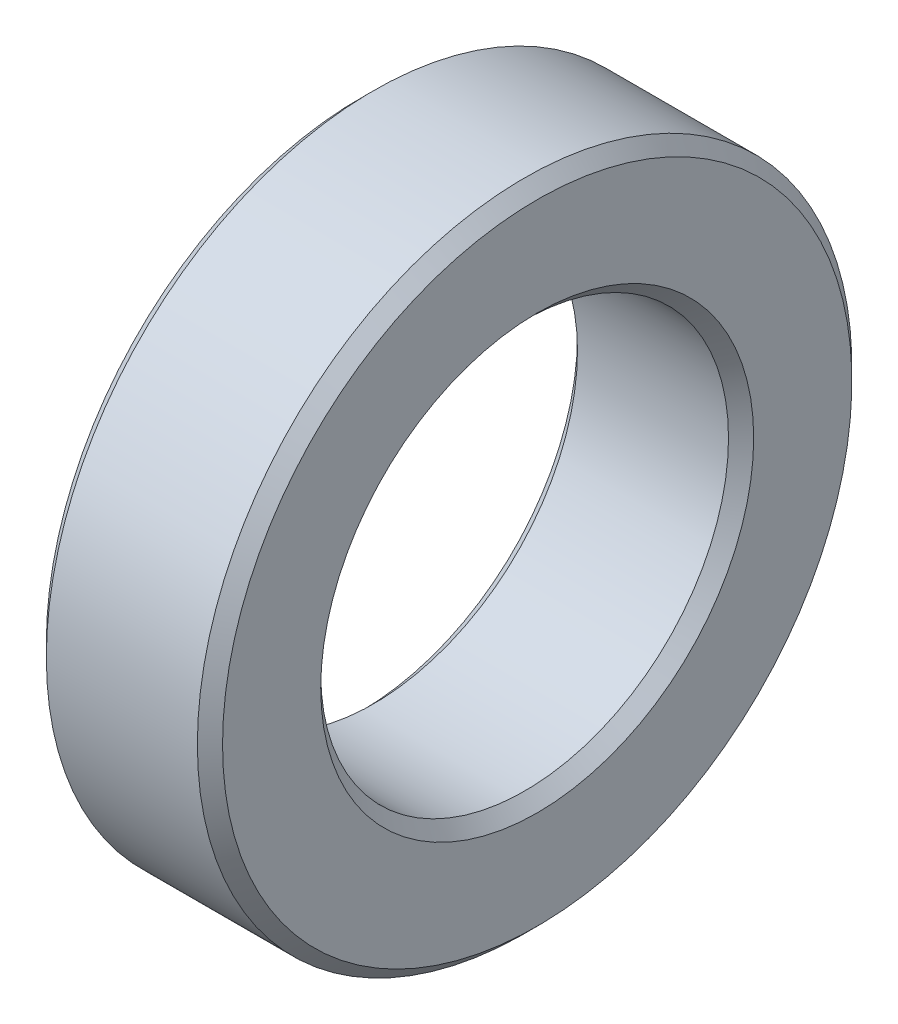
ISO-10303-21;
HEADER;
FILE_DESCRIPTION(('STEP AP214'),'2;1');
FILE_NAME('part.step','',(''),(''),'','','');
FILE_SCHEMA(('AUTOMOTIVE_DESIGN { 1 0 10303 214 1 1 1 1 }'));
ENDSEC;
DATA;
#1=APPLICATION_CONTEXT('core data for automotive mechanical design processes');
#2=APPLICATION_PROTOCOL_DEFINITION('international standard','automotive_design',2000,#1);
#3=PRODUCT_CONTEXT('',#1,'mechanical');
#4=PRODUCT('Part','Part','',(#3));
#5=PRODUCT_RELATED_PRODUCT_CATEGORY('part','',(#4));
#6=PRODUCT_DEFINITION_FORMATION('','',#4);
#7=PRODUCT_DEFINITION_CONTEXT('part definition',#1,'design');
#8=PRODUCT_DEFINITION('design','',#6,#7);
#9=PRODUCT_DEFINITION_SHAPE('','',#8);
#10=(LENGTH_UNIT() NAMED_UNIT(*) SI_UNIT(.MILLI.,.METRE.));
#11=(NAMED_UNIT(*) PLANE_ANGLE_UNIT() SI_UNIT($,.RADIAN.));
#12=(NAMED_UNIT(*) SI_UNIT($,.STERADIAN.) SOLID_ANGLE_UNIT());
#13=UNCERTAINTY_MEASURE_WITH_UNIT(LENGTH_MEASURE(1.E-05),#10,'distance_accuracy_value','');
#14=(GEOMETRIC_REPRESENTATION_CONTEXT(3) GLOBAL_UNCERTAINTY_ASSIGNED_CONTEXT((#13)) GLOBAL_UNIT_ASSIGNED_CONTEXT((#10,
#11,#12)) REPRESENTATION_CONTEXT('',''));
#15=CARTESIAN_POINT('',(0.,0.,0.));
#16=DIRECTION('',(0.,0.,1.));
#17=DIRECTION('',(1.,0.,0.));
#18=AXIS2_PLACEMENT_3D('',#15,#16,#17);
#19=CARTESIAN_POINT('',(0.,0.,0.));
#20=DIRECTION('',(-1.,0.,0.));
#21=DIRECTION('',(0.,0.,1.));
#22=AXIS2_PLACEMENT_3D('',#19,#20,#21);
#23=PLANE('',#22);
#24=CARTESIAN_POINT('',(0.,0.,0.));
#25=DIRECTION('',(-1.,0.,0.));
#26=DIRECTION('',(0.,0.,1.));
#27=AXIS2_PLACEMENT_3D('',#24,#25,#26);
#28=CIRCLE('',#27,8.6);
#29=CARTESIAN_POINT('',(0.,0.,8.6));
#30=VERTEX_POINT('',#29);
#31=EDGE_CURVE('E63',#30,#30,#28,.F.);
#32=ORIENTED_EDGE('',*,*,#31,.T.);
#33=EDGE_LOOP('',(#32));
#34=FACE_BOUND('',#33,.T.);
#35=CARTESIAN_POINT('',(0.,0.,0.));
#36=DIRECTION('',(-1.,0.,0.));
#37=DIRECTION('',(0.,0.,1.));
#38=AXIS2_PLACEMENT_3D('',#35,#36,#37);
#39=CIRCLE('',#38,12.5);
#40=CARTESIAN_POINT('',(0.,0.,12.5));
#41=VERTEX_POINT('',#40);
#42=EDGE_CURVE('E70',#41,#41,#39,.T.);
#43=ORIENTED_EDGE('',*,*,#42,.T.);
#44=EDGE_LOOP('',(#43));
#45=FACE_BOUND('',#44,.T.);
#46=ADVANCED_FACE('F43',(#34,#45),#23,.T.);
#47=CARTESIAN_POINT('',(0.,0.,0.));
#48=DIRECTION('',(-1.,0.,0.));
#49=DIRECTION('',(0.,0.,1.));
#50=AXIS2_PLACEMENT_3D('',#47,#48,#49);
#51=CYLINDRICAL_SURFACE('',#50,8.1);
#52=CARTESIAN_POINT('',(0.5,0.,0.));
#53=DIRECTION('',(-1.,0.,0.));
#54=DIRECTION('',(0.,0.,1.));
#55=AXIS2_PLACEMENT_3D('',#52,#53,#54);
#56=CIRCLE('',#55,8.1);
#57=CARTESIAN_POINT('',(0.5,0.,8.1));
#58=VERTEX_POINT('',#57);
#59=EDGE_CURVE('E66',#58,#58,#56,.T.);
#60=ORIENTED_EDGE('',*,*,#59,.T.);
#61=EDGE_LOOP('',(#60));
#62=FACE_BOUND('',#61,.T.);
#63=CARTESIAN_POINT('',(6.50000000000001,0.,0.));
#64=DIRECTION('',(-1.,0.,0.));
#65=DIRECTION('',(0.,0.,1.));
#66=AXIS2_PLACEMENT_3D('',#63,#64,#65);
#67=CIRCLE('',#66,8.1);
#68=CARTESIAN_POINT('',(6.50000000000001,0.,8.1));
#69=VERTEX_POINT('',#68);
#70=EDGE_CURVE('E71',#69,#69,#67,.F.);
#71=ORIENTED_EDGE('',*,*,#70,.T.);
#72=EDGE_LOOP('',(#71));
#73=FACE_BOUND('',#72,.T.);
#74=ADVANCED_FACE('F80',(#62,#73),#51,.F.);
#75=CARTESIAN_POINT('',(7.,0.,0.));
#76=DIRECTION('',(-1.,0.,0.));
#77=DIRECTION('',(0.,0.,1.));
#78=AXIS2_PLACEMENT_3D('',#75,#76,#77);
#79=PLANE('',#78);
#80=CARTESIAN_POINT('',(7.,0.,0.));
#81=DIRECTION('',(-1.,0.,0.));
#82=DIRECTION('',(0.,0.,1.));
#83=AXIS2_PLACEMENT_3D('',#80,#81,#82);
#84=CIRCLE('',#83,12.5);
#85=CARTESIAN_POINT('',(7.,0.,12.5));
#86=VERTEX_POINT('',#85);
#87=EDGE_CURVE('E10',#86,#86,#84,.F.);
#88=ORIENTED_EDGE('',*,*,#87,.T.);
#89=EDGE_LOOP('',(#88));
#90=FACE_BOUND('',#89,.T.);
#91=CARTESIAN_POINT('',(7.,0.,0.));
#92=DIRECTION('',(-1.,0.,0.));
#93=DIRECTION('',(0.,0.,1.));
#94=AXIS2_PLACEMENT_3D('',#91,#92,#93);
#95=CIRCLE('',#94,8.59999999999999);
#96=CARTESIAN_POINT('',(7.,0.,8.59999999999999));
#97=VERTEX_POINT('',#96);
#98=EDGE_CURVE('E51',#97,#97,#95,.T.);
#99=ORIENTED_EDGE('',*,*,#98,.T.);
#100=EDGE_LOOP('',(#99));
#101=FACE_BOUND('',#100,.T.);
#102=ADVANCED_FACE('F91',(#90,#101),#79,.F.);
#103=CARTESIAN_POINT('',(0.,0.,0.));
#104=DIRECTION('',(-1.,0.,0.));
#105=DIRECTION('',(0.,0.,1.));
#106=AXIS2_PLACEMENT_3D('',#103,#104,#105);
#107=CYLINDRICAL_SURFACE('',#106,13.);
#108=CARTESIAN_POINT('',(0.499999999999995,0.,0.));
#109=DIRECTION('',(-1.,0.,0.));
#110=DIRECTION('',(0.,0.,1.));
#111=AXIS2_PLACEMENT_3D('',#108,#109,#110);
#112=CIRCLE('',#111,13.);
#113=CARTESIAN_POINT('',(0.499999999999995,0.,13.));
#114=VERTEX_POINT('',#113);
#115=EDGE_CURVE('E54',#114,#114,#112,.F.);
#116=ORIENTED_EDGE('',*,*,#115,.T.);
#117=EDGE_LOOP('',(#116));
#118=FACE_BOUND('',#117,.T.);
#119=CARTESIAN_POINT('',(6.5,0.,0.));
#120=DIRECTION('',(-1.,0.,0.));
#121=DIRECTION('',(0.,0.,1.));
#122=AXIS2_PLACEMENT_3D('',#119,#120,#121);
#123=CIRCLE('',#122,13.);
#124=CARTESIAN_POINT('',(6.5,0.,13.));
#125=VERTEX_POINT('',#124);
#126=EDGE_CURVE('E56',#125,#125,#123,.T.);
#127=ORIENTED_EDGE('',*,*,#126,.T.);
#128=EDGE_LOOP('',(#127));
#129=FACE_BOUND('',#128,.T.);
#130=ADVANCED_FACE('F106',(#118,#129),#107,.T.);
#131=CARTESIAN_POINT('',(0.5,0.,0.));
#132=DIRECTION('',(-1.,0.,0.));
#133=DIRECTION('',(0.,0.,1.));
#134=AXIS2_PLACEMENT_3D('',#131,#132,#133);
#135=CONICAL_SURFACE('',#134,8.1,0.785398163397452);
#136=ORIENTED_EDGE('',*,*,#31,.F.);
#137=EDGE_LOOP('',(#136));
#138=FACE_BOUND('',#137,.T.);
#139=ORIENTED_EDGE('',*,*,#59,.F.);
#140=EDGE_LOOP('',(#139));
#141=FACE_BOUND('',#140,.T.);
#142=ADVANCED_FACE('F99',(#138,#141),#135,.F.);
#143=CARTESIAN_POINT('',(0.,0.,0.));
#144=DIRECTION('',(1.,0.,0.));
#145=DIRECTION('',(0.,0.,-1.));
#146=AXIS2_PLACEMENT_3D('',#143,#144,#145);
#147=CONICAL_SURFACE('',#146,12.5,0.785398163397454);
#148=ORIENTED_EDGE('',*,*,#115,.F.);
#149=EDGE_LOOP('',(#148));
#150=FACE_BOUND('',#149,.T.);
#151=ORIENTED_EDGE('',*,*,#42,.F.);
#152=EDGE_LOOP('',(#151));
#153=FACE_BOUND('',#152,.T.);
#154=ADVANCED_FACE('F81',(#150,#153),#147,.T.);
#155=CARTESIAN_POINT('',(6.5,0.,0.));
#156=DIRECTION('',(-1.,0.,0.));
#157=DIRECTION('',(0.,0.,1.));
#158=AXIS2_PLACEMENT_3D('',#155,#156,#157);
#159=CONICAL_SURFACE('',#158,13.,0.785398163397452);
#160=ORIENTED_EDGE('',*,*,#87,.F.);
#161=EDGE_LOOP('',(#160));
#162=FACE_BOUND('',#161,.T.);
#163=ORIENTED_EDGE('',*,*,#126,.F.);
#164=EDGE_LOOP('',(#163));
#165=FACE_BOUND('',#164,.T.);
#166=ADVANCED_FACE('F82',(#162,#165),#159,.T.);
#167=CARTESIAN_POINT('',(7.,0.,0.));
#168=DIRECTION('',(1.,0.,0.));
#169=DIRECTION('',(0.,0.,-1.));
#170=AXIS2_PLACEMENT_3D('',#167,#168,#169);
#171=CONICAL_SURFACE('',#170,8.59999999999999,0.785398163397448);
#172=ORIENTED_EDGE('',*,*,#70,.F.);
#173=EDGE_LOOP('',(#172));
#174=FACE_BOUND('',#173,.T.);
#175=ORIENTED_EDGE('',*,*,#98,.F.);
#176=EDGE_LOOP('',(#175));
#177=FACE_BOUND('',#176,.T.);
#178=ADVANCED_FACE('F46',(#174,#177),#171,.F.);
#179=CLOSED_SHELL('',(#46,#74,#102,#130,#142,#154,#166,#178));
#180=MANIFOLD_SOLID_BREP('B2',#179);
#181=ADVANCED_BREP_SHAPE_REPRESENTATION('',(#18,#180),#14);
#182=SHAPE_DEFINITION_REPRESENTATION(#9,#181);
ENDSEC;
END-ISO-10303-21;
